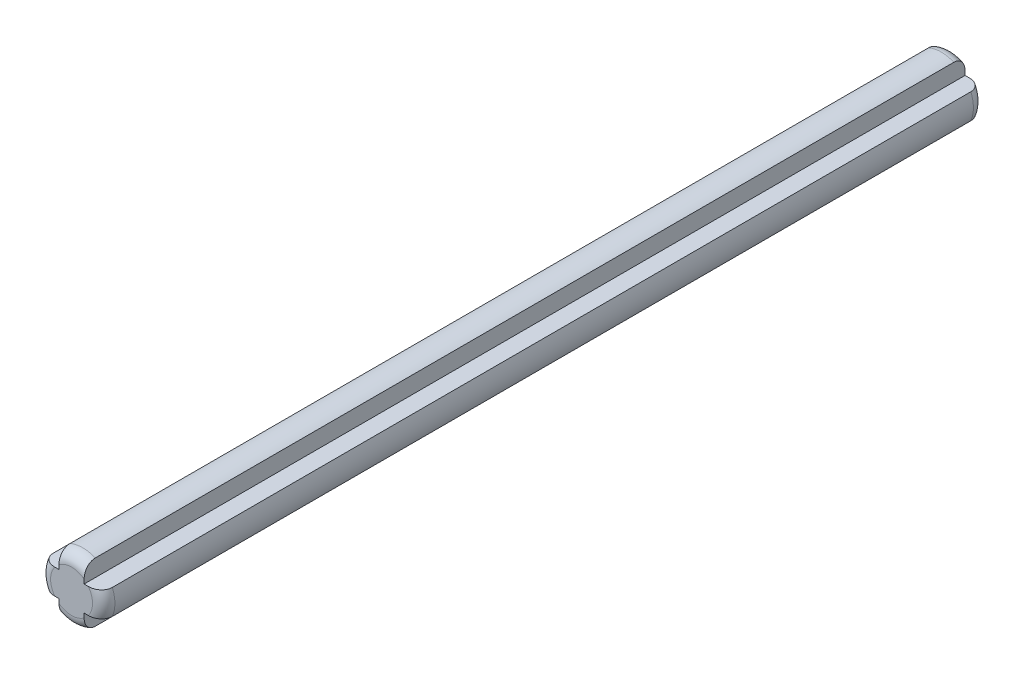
ISO-10303-21;
HEADER;
FILE_DESCRIPTION(('STEP AP214'),'2;1');
FILE_NAME('part.step','',(''),(''),'','','');
FILE_SCHEMA(('AUTOMOTIVE_DESIGN { 1 0 10303 214 1 1 1 1 }'));
ENDSEC;
DATA;
#1=APPLICATION_CONTEXT('core data for automotive mechanical design processes');
#2=APPLICATION_PROTOCOL_DEFINITION('international standard','automotive_design',2000,#1);
#3=PRODUCT_CONTEXT('',#1,'mechanical');
#4=PRODUCT('Part','Part','',(#3));
#5=PRODUCT_RELATED_PRODUCT_CATEGORY('part','',(#4));
#6=PRODUCT_DEFINITION_FORMATION('','',#4);
#7=PRODUCT_DEFINITION_CONTEXT('part definition',#1,'design');
#8=PRODUCT_DEFINITION('design','',#6,#7);
#9=PRODUCT_DEFINITION_SHAPE('','',#8);
#10=(LENGTH_UNIT() NAMED_UNIT(*) SI_UNIT(.MILLI.,.METRE.));
#11=(NAMED_UNIT(*) PLANE_ANGLE_UNIT() SI_UNIT($,.RADIAN.));
#12=(NAMED_UNIT(*) SI_UNIT($,.STERADIAN.) SOLID_ANGLE_UNIT());
#13=UNCERTAINTY_MEASURE_WITH_UNIT(LENGTH_MEASURE(1.E-05),#10,'distance_accuracy_value','');
#14=(GEOMETRIC_REPRESENTATION_CONTEXT(3) GLOBAL_UNCERTAINTY_ASSIGNED_CONTEXT((#13)) GLOBAL_UNIT_ASSIGNED_CONTEXT((#10,
#11,#12)) REPRESENTATION_CONTEXT('',''));
#15=CARTESIAN_POINT('',(0.,0.,0.));
#16=DIRECTION('',(0.,0.,1.));
#17=DIRECTION('',(1.,0.,0.));
#18=AXIS2_PLACEMENT_3D('',#15,#16,#17);
#19=CARTESIAN_POINT('',(0.9,0.,-63.));
#20=DIRECTION('',(-1.,0.,0.));
#21=DIRECTION('',(0.,0.,1.));
#22=AXIS2_PLACEMENT_3D('',#19,#20,#21);
#23=PLANE('',#22);
#24=DIRECTION('',(0.,-1.,0.));
#25=VECTOR('',#24,1.);
#26=CARTESIAN_POINT('',(0.9,0.,-63.));
#27=LINE('',#26,#25);
#28=CARTESIAN_POINT('',(0.9,1.2,-63.));
#29=VERTEX_POINT('',#28);
#30=CARTESIAN_POINT('',(0.9,0.9,-63.));
#31=VERTEX_POINT('',#30);
#32=EDGE_CURVE('E202',#29,#31,#27,.T.);
#33=ORIENTED_EDGE('',*,*,#32,.F.);
#34=CARTESIAN_POINT('',(0.9,1.2,-63.));
#35=CARTESIAN_POINT('',(0.9,1.23177264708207,-62.9999988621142));
#36=CARTESIAN_POINT('',(0.9,1.26353737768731,-62.9987861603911));
#37=CARTESIAN_POINT('',(0.9,1.32690893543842,-62.9937439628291));
#38=CARTESIAN_POINT('',(0.9,1.35851541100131,-62.9899101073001));
#39=CARTESIAN_POINT('',(0.9,1.45291091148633,-62.9741597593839));
#40=CARTESIAN_POINT('',(0.9,1.51508424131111,-62.9579921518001));
#41=CARTESIAN_POINT('',(0.9,1.62122301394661,-62.9186762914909));
#42=CARTESIAN_POINT('',(0.9,1.66610240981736,-62.8979677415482));
#43=CARTESIAN_POINT('',(0.9,1.75174308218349,-62.8494286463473));
#44=CARTESIAN_POINT('',(0.9,1.79251387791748,-62.8216151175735));
#45=CARTESIAN_POINT('',(0.9,1.86875694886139,-62.7590609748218));
#46=CARTESIAN_POINT('',(0.9,1.90419849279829,-62.7242826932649));
#47=CARTESIAN_POINT('',(0.9,1.96804173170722,-62.6487024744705));
#48=CARTESIAN_POINT('',(0.9,1.99643996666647,-62.607897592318));
#49=CARTESIAN_POINT('',(0.9,2.04263429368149,-62.5255349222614));
#50=CARTESIAN_POINT('',(0.9,2.06116131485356,-62.4843855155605));
#51=CARTESIAN_POINT('',(0.9,2.09051404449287,-62.3994647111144));
#52=CARTESIAN_POINT('',(0.9,2.10135386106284,-62.3556982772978));
#53=CARTESIAN_POINT('',(0.9,2.11095369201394,-62.2929302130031));
#54=CARTESIAN_POINT('',(0.9,2.11307132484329,-62.2743928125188));
#55=CARTESIAN_POINT('',(0.9,2.11589349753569,-62.2372401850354));
#56=CARTESIAN_POINT('',(0.9,2.1166002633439,-62.2186251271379));
#57=CARTESIAN_POINT('',(0.9,2.11660104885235,-62.2000000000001));
#58=B_SPLINE_CURVE_WITH_KNOTS('',3,(#34,#35,#36,#37,#38,#39,#40,#41,#42,#43,#44,#45,#46,#47,#48,
#49,#50,#51,#52,#53,#54,#55,#56,#57),.UNSPECIFIED.,.F.,.F.,(4,2,2,2,2,2,2,2,2,2,2,4),(0.,
0.0952699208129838,0.190698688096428,0.38212422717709,0.529802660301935,0.677130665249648,
0.825278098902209,0.973498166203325,1.10819470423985,1.24264339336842,1.29857368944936,
1.35441567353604),.UNSPECIFIED.);
#59=CARTESIAN_POINT('',(0.9,2.11660104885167,-62.2));
#60=VERTEX_POINT('',#59);
#61=EDGE_CURVE('E366',#29,#60,#58,.T.);
#62=ORIENTED_EDGE('',*,*,#61,.T.);
#63=DIRECTION('',(0.,0.,1.));
#64=VECTOR('',#63,1.);
#65=CARTESIAN_POINT('',(0.9,2.11660104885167,-63.));
#66=LINE('',#65,#64);
#67=CARTESIAN_POINT('',(0.9,2.11660104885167,-0.800000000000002));
#68=VERTEX_POINT('',#67);
#69=EDGE_CURVE('E232',#60,#68,#66,.T.);
#70=ORIENTED_EDGE('',*,*,#69,.T.);
#71=CARTESIAN_POINT('',(0.9,2.11660104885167,-0.800000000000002));
#72=CARTESIAN_POINT('',(0.9,2.11664820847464,-0.757867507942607));
#73=CARTESIAN_POINT('',(0.9,2.11298761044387,-0.715759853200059));
#74=CARTESIAN_POINT('',(0.9,2.09861504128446,-0.63286952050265));
#75=CARTESIAN_POINT('',(0.9,2.08792060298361,-0.592083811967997));
#76=CARTESIAN_POINT('',(0.9,2.05984193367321,-0.512893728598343));
#77=CARTESIAN_POINT('',(0.9,2.0424580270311,-0.474489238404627));
#78=CARTESIAN_POINT('',(0.9,2.00163237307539,-0.401044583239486));
#79=CARTESIAN_POINT('',(0.9,1.9781885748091,-0.36600556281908));
#80=CARTESIAN_POINT('',(0.9,1.92541056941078,-0.299327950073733));
#81=CARTESIAN_POINT('',(0.9,1.89594969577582,-0.267789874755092));
#82=CARTESIAN_POINT('',(0.9,1.83247761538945,-0.209727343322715));
#83=CARTESIAN_POINT('',(0.9,1.79846712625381,-0.183202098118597));
#84=CARTESIAN_POINT('',(0.9,1.72434385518,-0.13382906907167));
#85=CARTESIAN_POINT('',(0.9,1.68396944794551,-0.111374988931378));
#86=CARTESIAN_POINT('',(0.9,1.60027120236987,-0.0727387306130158));
#87=CARTESIAN_POINT('',(0.9,1.55694210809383,-0.0565680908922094));
#88=CARTESIAN_POINT('',(0.9,1.46195018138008,-0.0284954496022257));
#89=CARTESIAN_POINT('',(0.9,1.40999804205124,-0.0175692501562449));
#90=CARTESIAN_POINT('',(0.9,1.33146710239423,-0.00688571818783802));
#91=CARTESIAN_POINT('',(0.9,1.30523100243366,-0.0042751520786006));
#92=CARTESIAN_POINT('',(0.9,1.25266468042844,-0.000833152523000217));
#93=CARTESIAN_POINT('',(0.9,1.22633456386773,-1.25965905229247E-07));
#94=CARTESIAN_POINT('',(0.9,1.2,0.));
#95=B_SPLINE_CURVE_WITH_KNOTS('',3,(#71,#72,#73,#74,#75,#76,#77,#78,#79,#80,#81,#82,#83,#84,#85,
#86,#87,#88,#89,#90,#91,#92,#93,#94),.UNSPECIFIED.,.F.,.F.,(4,2,2,2,2,2,2,2,2,2,2,4),(0.,
0.12620055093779,0.252087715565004,0.377968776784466,0.503892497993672,0.632806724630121,
0.761700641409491,0.899726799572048,1.03800523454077,1.19659344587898,1.27564166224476,
1.35461900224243),.UNSPECIFIED.);
#96=CARTESIAN_POINT('',(0.9,1.2,0.));
#97=VERTEX_POINT('',#96);
#98=EDGE_CURVE('E373',#68,#97,#95,.T.);
#99=ORIENTED_EDGE('',*,*,#98,.T.);
#100=DIRECTION('',(0.,-1.,0.));
#101=VECTOR('',#100,1.);
#102=CARTESIAN_POINT('',(0.9,0.,0.));
#103=LINE('',#102,#101);
#104=CARTESIAN_POINT('',(0.9,0.9,0.));
#105=VERTEX_POINT('',#104);
#106=EDGE_CURVE('E233',#97,#105,#103,.T.);
#107=ORIENTED_EDGE('',*,*,#106,.T.);
#108=DIRECTION('',(0.,0.,1.));
#109=VECTOR('',#108,1.);
#110=CARTESIAN_POINT('',(0.9,0.9,-63.));
#111=LINE('',#110,#109);
#112=EDGE_CURVE('E251',#31,#105,#111,.T.);
#113=ORIENTED_EDGE('',*,*,#112,.F.);
#114=EDGE_LOOP('',(#33,#62,#70,#99,#107,#113));
#115=FACE_BOUND('',#114,.T.);
#116=ADVANCED_FACE('F45',(#115),#23,.F.);
#117=CARTESIAN_POINT('',(0.,0.9,-63.));
#118=DIRECTION('',(0.,-1.,0.));
#119=DIRECTION('',(0.,0.,-1.));
#120=AXIS2_PLACEMENT_3D('',#117,#118,#119);
#121=PLANE('',#120);
#122=DIRECTION('',(0.,0.,1.));
#123=VECTOR('',#122,1.);
#124=CARTESIAN_POINT('',(2.11660104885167,0.9,-63.));
#125=LINE('',#124,#123);
#126=CARTESIAN_POINT('',(2.11660104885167,0.9,-62.2));
#127=VERTEX_POINT('',#126);
#128=CARTESIAN_POINT('',(2.11660104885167,0.9,-0.800000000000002));
#129=VERTEX_POINT('',#128);
#130=EDGE_CURVE('E255',#127,#129,#125,.T.);
#131=ORIENTED_EDGE('',*,*,#130,.F.);
#132=CARTESIAN_POINT('',(2.11660104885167,0.9,-62.2));
#133=CARTESIAN_POINT('',(2.11664820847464,0.9,-62.2421324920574));
#134=CARTESIAN_POINT('',(2.11298761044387,0.9,-62.2842401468));
#135=CARTESIAN_POINT('',(2.09861504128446,0.9,-62.3671304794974));
#136=CARTESIAN_POINT('',(2.0879206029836,0.9,-62.407916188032));
#137=CARTESIAN_POINT('',(2.05984193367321,0.9,-62.4871062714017));
#138=CARTESIAN_POINT('',(2.0424580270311,0.9,-62.5255107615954));
#139=CARTESIAN_POINT('',(2.00163237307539,0.9,-62.5989554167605));
#140=CARTESIAN_POINT('',(1.9781885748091,0.9,-62.6339944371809));
#141=CARTESIAN_POINT('',(1.92541056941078,0.9,-62.7006720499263));
#142=CARTESIAN_POINT('',(1.89594969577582,0.9,-62.7322101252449));
#143=CARTESIAN_POINT('',(1.83247761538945,0.9,-62.7902726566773));
#144=CARTESIAN_POINT('',(1.7984671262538,0.9,-62.8167979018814));
#145=CARTESIAN_POINT('',(1.72434385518,0.9,-62.8661709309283));
#146=CARTESIAN_POINT('',(1.68396944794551,0.9,-62.8886250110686));
#147=CARTESIAN_POINT('',(1.60027120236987,0.9,-62.927261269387));
#148=CARTESIAN_POINT('',(1.55694210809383,0.9,-62.9434319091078));
#149=CARTESIAN_POINT('',(1.46195018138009,0.9,-62.9715045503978));
#150=CARTESIAN_POINT('',(1.40999804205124,0.9,-62.9824307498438));
#151=CARTESIAN_POINT('',(1.33146710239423,0.9,-62.9931142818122));
#152=CARTESIAN_POINT('',(1.30523100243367,0.9,-62.9957248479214));
#153=CARTESIAN_POINT('',(1.25266468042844,0.9,-62.999166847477));
#154=CARTESIAN_POINT('',(1.22633456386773,0.9,-62.9999998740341));
#155=CARTESIAN_POINT('',(1.2,0.9,-63.));
#156=B_SPLINE_CURVE_WITH_KNOTS('',3,(#132,#133,#134,#135,#136,#137,#138,#139,#140,#141,#142,
#143,#144,#145,#146,#147,#148,#149,#150,#151,#152,#153,#154,#155),.UNSPECIFIED.,.F.,.F.,(4,2,2,
2,2,2,2,2,2,2,2,4),(0.,0.126200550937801,0.252087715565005,0.377968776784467,0.503892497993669,
0.632806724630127,0.761700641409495,0.899726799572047,1.03800523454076,1.19659344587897,
1.27564166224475,1.35461900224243),.UNSPECIFIED.);
#157=CARTESIAN_POINT('',(1.2,0.9,-63.));
#158=VERTEX_POINT('',#157);
#159=EDGE_CURVE('E293',#127,#158,#156,.T.);
#160=ORIENTED_EDGE('',*,*,#159,.T.);
#161=DIRECTION('',(1.,0.,0.));
#162=VECTOR('',#161,1.);
#163=CARTESIAN_POINT('',(0.,0.9,-63.));
#164=LINE('',#163,#162);
#165=EDGE_CURVE('E230',#31,#158,#164,.T.);
#166=ORIENTED_EDGE('',*,*,#165,.F.);
#167=ORIENTED_EDGE('',*,*,#112,.T.);
#168=DIRECTION('',(1.,0.,0.));
#169=VECTOR('',#168,1.);
#170=CARTESIAN_POINT('',(0.,0.9,0.));
#171=LINE('',#170,#169);
#172=CARTESIAN_POINT('',(1.2,0.9,0.));
#173=VERTEX_POINT('',#172);
#174=EDGE_CURVE('E248',#105,#173,#171,.T.);
#175=ORIENTED_EDGE('',*,*,#174,.T.);
#176=CARTESIAN_POINT('',(1.2,0.9,0.));
#177=CARTESIAN_POINT('',(1.23177264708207,0.9,-1.13788575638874E-06));
#178=CARTESIAN_POINT('',(1.26353737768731,0.9,-0.00121383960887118));
#179=CARTESIAN_POINT('',(1.32690893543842,0.9,-0.00625603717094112));
#180=CARTESIAN_POINT('',(1.35851541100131,0.9,-0.0100898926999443));
#181=CARTESIAN_POINT('',(1.45291091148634,0.9,-0.0258402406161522));
#182=CARTESIAN_POINT('',(1.51508424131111,0.9,-0.0420078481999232));
#183=CARTESIAN_POINT('',(1.62122301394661,0.9,-0.0813237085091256));
#184=CARTESIAN_POINT('',(1.66610240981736,0.9,-0.102032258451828));
#185=CARTESIAN_POINT('',(1.7517430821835,0.9,-0.150571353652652));
#186=CARTESIAN_POINT('',(1.79251387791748,0.9,-0.178384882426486));
#187=CARTESIAN_POINT('',(1.8687569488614,0.9,-0.240939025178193));
#188=CARTESIAN_POINT('',(1.9041984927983,0.9,-0.275717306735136));
#189=CARTESIAN_POINT('',(1.96804173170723,0.9,-0.351297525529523));
#190=CARTESIAN_POINT('',(1.99643996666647,0.9,-0.392102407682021));
#191=CARTESIAN_POINT('',(2.04263429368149,0.9,-0.474465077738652));
#192=CARTESIAN_POINT('',(2.06116131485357,0.9,-0.515614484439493));
#193=CARTESIAN_POINT('',(2.09051404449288,0.9,-0.600535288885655));
#194=CARTESIAN_POINT('',(2.10135386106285,0.9,-0.644301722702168));
#195=CARTESIAN_POINT('',(2.11095369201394,0.9,-0.707069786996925));
#196=CARTESIAN_POINT('',(2.11307132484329,0.9,-0.725607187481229));
#197=CARTESIAN_POINT('',(2.11589349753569,0.9,-0.762759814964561));
#198=CARTESIAN_POINT('',(2.1166002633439,0.9,-0.781374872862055));
#199=CARTESIAN_POINT('',(2.11660104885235,0.9,-0.799999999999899));
#200=B_SPLINE_CURVE_WITH_KNOTS('',3,(#176,#177,#178,#179,#180,#181,#182,#183,#184,#185,#186,
#187,#188,#189,#190,#191,#192,#193,#194,#195,#196,#197,#198,#199),.UNSPECIFIED.,.F.,.F.,(4,2,2,
2,2,2,2,2,2,2,2,4),(0.,0.0952699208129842,0.190698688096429,0.382124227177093,0.52980266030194,
0.677130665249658,0.82527809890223,0.973498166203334,1.10819470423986,1.24264339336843,
1.29857368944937,1.35441567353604),.UNSPECIFIED.);
#201=EDGE_CURVE('E285',#173,#129,#200,.T.);
#202=ORIENTED_EDGE('',*,*,#201,.T.);
#203=EDGE_LOOP('',(#131,#160,#166,#167,#175,#202));
#204=FACE_BOUND('',#203,.T.);
#205=ADVANCED_FACE('F303',(#204),#121,.F.);
#206=CARTESIAN_POINT('',(0.,0.,-63.));
#207=DIRECTION('',(0.,0.,1.));
#208=DIRECTION('',(1.,0.,0.));
#209=AXIS2_PLACEMENT_3D('',#206,#207,#208);
#210=CYLINDRICAL_SURFACE('',#209,2.3);
#211=DIRECTION('',(0.,0.,1.));
#212=VECTOR('',#211,1.);
#213=CARTESIAN_POINT('',(2.11660104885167,-0.9,-63.));
#214=LINE('',#213,#212);
#215=CARTESIAN_POINT('',(2.11660104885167,-0.9,-62.2));
#216=VERTEX_POINT('',#215);
#217=CARTESIAN_POINT('',(2.11660104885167,-0.9,-0.800000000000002));
#218=VERTEX_POINT('',#217);
#219=EDGE_CURVE('E258',#216,#218,#214,.T.);
#220=ORIENTED_EDGE('',*,*,#219,.F.);
#221=CARTESIAN_POINT('',(0.,0.,-62.2));
#222=DIRECTION('',(0.,0.,1.));
#223=DIRECTION('',(1.,0.,0.));
#224=AXIS2_PLACEMENT_3D('',#221,#222,#223);
#225=CIRCLE('',#224,2.3);
#226=EDGE_CURVE('E282',#216,#127,#225,.T.);
#227=ORIENTED_EDGE('',*,*,#226,.T.);
#228=ORIENTED_EDGE('',*,*,#130,.T.);
#229=CARTESIAN_POINT('',(0.,0.,-0.800000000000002));
#230=DIRECTION('',(0.,0.,1.));
#231=DIRECTION('',(1.,0.,0.));
#232=AXIS2_PLACEMENT_3D('',#229,#230,#231);
#233=CIRCLE('',#232,2.3);
#234=EDGE_CURVE('E254',#129,#218,#233,.F.);
#235=ORIENTED_EDGE('',*,*,#234,.T.);
#236=EDGE_LOOP('',(#220,#227,#228,#235));
#237=FACE_BOUND('',#236,.T.);
#238=ADVANCED_FACE('F308',(#237),#210,.T.);
#239=CARTESIAN_POINT('',(0.,-0.9,-63.));
#240=DIRECTION('',(0.,-1.,0.));
#241=DIRECTION('',(0.,0.,-1.));
#242=AXIS2_PLACEMENT_3D('',#239,#240,#241);
#243=PLANE('',#242);
#244=DIRECTION('',(1.,0.,0.));
#245=VECTOR('',#244,1.);
#246=CARTESIAN_POINT('',(0.,-0.9,-63.));
#247=LINE('',#246,#245);
#248=CARTESIAN_POINT('',(0.9,-0.9,-63.));
#249=VERTEX_POINT('',#248);
#250=CARTESIAN_POINT('',(1.2,-0.9,-63.));
#251=VERTEX_POINT('',#250);
#252=EDGE_CURVE('E227',#249,#251,#247,.T.);
#253=ORIENTED_EDGE('',*,*,#252,.T.);
#254=CARTESIAN_POINT('',(1.2,-0.9,-63.));
#255=CARTESIAN_POINT('',(1.23177264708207,-0.9,-62.9999988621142));
#256=CARTESIAN_POINT('',(1.26353737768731,-0.9,-62.9987861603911));
#257=CARTESIAN_POINT('',(1.32690893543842,-0.9,-62.9937439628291));
#258=CARTESIAN_POINT('',(1.35851541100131,-0.9,-62.9899101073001));
#259=CARTESIAN_POINT('',(1.45291091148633,-0.9,-62.9741597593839));
#260=CARTESIAN_POINT('',(1.51508424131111,-0.9,-62.9579921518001));
#261=CARTESIAN_POINT('',(1.62122301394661,-0.9,-62.9186762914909));
#262=CARTESIAN_POINT('',(1.66610240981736,-0.9,-62.8979677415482));
#263=CARTESIAN_POINT('',(1.75174308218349,-0.9,-62.8494286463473));
#264=CARTESIAN_POINT('',(1.79251387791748,-0.9,-62.8216151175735));
#265=CARTESIAN_POINT('',(1.86875694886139,-0.9,-62.7590609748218));
#266=CARTESIAN_POINT('',(1.90419849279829,-0.9,-62.7242826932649));
#267=CARTESIAN_POINT('',(1.96804173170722,-0.9,-62.6487024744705));
#268=CARTESIAN_POINT('',(1.99643996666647,-0.9,-62.607897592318));
#269=CARTESIAN_POINT('',(2.04263429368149,-0.9,-62.5255349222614));
#270=CARTESIAN_POINT('',(2.06116131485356,-0.9,-62.4843855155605));
#271=CARTESIAN_POINT('',(2.09051404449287,-0.9,-62.3994647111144));
#272=CARTESIAN_POINT('',(2.10135386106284,-0.9,-62.3556982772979));
#273=CARTESIAN_POINT('',(2.11095369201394,-0.9,-62.2929302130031));
#274=CARTESIAN_POINT('',(2.11307132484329,-0.9,-62.2743928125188));
#275=CARTESIAN_POINT('',(2.11589349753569,-0.9,-62.2372401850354));
#276=CARTESIAN_POINT('',(2.1166002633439,-0.9,-62.2186251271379));
#277=CARTESIAN_POINT('',(2.11660104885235,-0.9,-62.2000000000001));
#278=B_SPLINE_CURVE_WITH_KNOTS('',3,(#254,#255,#256,#257,#258,#259,#260,#261,#262,#263,#264,
#265,#266,#267,#268,#269,#270,#271,#272,#273,#274,#275,#276,#277),.UNSPECIFIED.,.F.,.F.,(4,2,2,
2,2,2,2,2,2,2,2,4),(0.,0.0952699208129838,0.190698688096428,0.38212422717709,0.529802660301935,
0.677130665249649,0.825278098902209,0.973498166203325,1.10819470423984,1.24264339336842,
1.29857368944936,1.35441567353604),.UNSPECIFIED.);
#279=EDGE_CURVE('E334',#251,#216,#278,.T.);
#280=ORIENTED_EDGE('',*,*,#279,.T.);
#281=ORIENTED_EDGE('',*,*,#219,.T.);
#282=CARTESIAN_POINT('',(2.11660104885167,-0.9,-0.800000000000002));
#283=CARTESIAN_POINT('',(2.11664820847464,-0.9,-0.757867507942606));
#284=CARTESIAN_POINT('',(2.11298761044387,-0.9,-0.715759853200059));
#285=CARTESIAN_POINT('',(2.09861504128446,-0.9,-0.63286952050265));
#286=CARTESIAN_POINT('',(2.0879206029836,-0.9,-0.592083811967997));
#287=CARTESIAN_POINT('',(2.05984193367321,-0.9,-0.512893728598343));
#288=CARTESIAN_POINT('',(2.0424580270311,-0.9,-0.474489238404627));
#289=CARTESIAN_POINT('',(2.00163237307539,-0.9,-0.401044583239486));
#290=CARTESIAN_POINT('',(1.9781885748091,-0.9,-0.36600556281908));
#291=CARTESIAN_POINT('',(1.92541056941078,-0.9,-0.299327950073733));
#292=CARTESIAN_POINT('',(1.89594969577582,-0.9,-0.267789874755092));
#293=CARTESIAN_POINT('',(1.83247761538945,-0.9,-0.209727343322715));
#294=CARTESIAN_POINT('',(1.79846712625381,-0.9,-0.183202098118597));
#295=CARTESIAN_POINT('',(1.72434385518,-0.9,-0.13382906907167));
#296=CARTESIAN_POINT('',(1.68396944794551,-0.9,-0.111374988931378));
#297=CARTESIAN_POINT('',(1.60027120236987,-0.9,-0.0727387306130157));
#298=CARTESIAN_POINT('',(1.55694210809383,-0.9,-0.0565680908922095));
#299=CARTESIAN_POINT('',(1.46195018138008,-0.9,-0.0284954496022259));
#300=CARTESIAN_POINT('',(1.40999804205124,-0.9,-0.0175692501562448));
#301=CARTESIAN_POINT('',(1.33146710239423,-0.9,-0.00688571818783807));
#302=CARTESIAN_POINT('',(1.30523100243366,-0.9,-0.00427515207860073));
#303=CARTESIAN_POINT('',(1.25266468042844,-0.9,-0.000833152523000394));
#304=CARTESIAN_POINT('',(1.22633456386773,-0.9,-1.25965905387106E-07));
#305=CARTESIAN_POINT('',(1.2,-0.9,0.));
#306=B_SPLINE_CURVE_WITH_KNOTS('',3,(#282,#283,#284,#285,#286,#287,#288,#289,#290,#291,#292,
#293,#294,#295,#296,#297,#298,#299,#300,#301,#302,#303,#304,#305),.UNSPECIFIED.,.F.,.F.,(4,2,2,
2,2,2,2,2,2,2,2,4),(0.,0.126200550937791,0.252087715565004,0.377968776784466,0.503892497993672,
0.632806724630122,0.761700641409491,0.899726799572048,1.03800523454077,1.19659344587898,
1.27564166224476,1.35461900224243),.UNSPECIFIED.);
#307=CARTESIAN_POINT('',(1.2,-0.9,0.));
#308=VERTEX_POINT('',#307);
#309=EDGE_CURVE('E327',#218,#308,#306,.T.);
#310=ORIENTED_EDGE('',*,*,#309,.T.);
#311=DIRECTION('',(1.,0.,0.));
#312=VECTOR('',#311,1.);
#313=CARTESIAN_POINT('',(0.,-0.9,0.));
#314=LINE('',#313,#312);
#315=CARTESIAN_POINT('',(0.9,-0.9,0.));
#316=VERTEX_POINT('',#315);
#317=EDGE_CURVE('E245',#316,#308,#314,.T.);
#318=ORIENTED_EDGE('',*,*,#317,.F.);
#319=DIRECTION('',(0.,0.,1.));
#320=VECTOR('',#319,1.);
#321=CARTESIAN_POINT('',(0.9,-0.9,-63.));
#322=LINE('',#321,#320);
#323=EDGE_CURVE('E261',#249,#316,#322,.T.);
#324=ORIENTED_EDGE('',*,*,#323,.F.);
#325=EDGE_LOOP('',(#253,#280,#281,#310,#318,#324));
#326=FACE_BOUND('',#325,.T.);
#327=ADVANCED_FACE('F315',(#326),#243,.T.);
#328=CARTESIAN_POINT('',(0.9,0.,-63.));
#329=DIRECTION('',(1.,0.,0.));
#330=DIRECTION('',(0.,0.,-1.));
#331=AXIS2_PLACEMENT_3D('',#328,#329,#330);
#332=PLANE('',#331);
#333=DIRECTION('',(0.,0.,1.));
#334=VECTOR('',#333,1.);
#335=CARTESIAN_POINT('',(0.9,-2.11660104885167,-63.));
#336=LINE('',#335,#334);
#337=CARTESIAN_POINT('',(0.9,-2.11660104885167,-62.2));
#338=VERTEX_POINT('',#337);
#339=CARTESIAN_POINT('',(0.9,-2.11660104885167,-0.800000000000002));
#340=VERTEX_POINT('',#339);
#341=EDGE_CURVE('E264',#338,#340,#336,.T.);
#342=ORIENTED_EDGE('',*,*,#341,.F.);
#343=CARTESIAN_POINT('',(0.9,-2.11660104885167,-62.2));
#344=CARTESIAN_POINT('',(0.9,-2.11664820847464,-62.2421324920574));
#345=CARTESIAN_POINT('',(0.9,-2.11298761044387,-62.2842401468));
#346=CARTESIAN_POINT('',(0.9,-2.09861504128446,-62.3671304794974));
#347=CARTESIAN_POINT('',(0.9,-2.0879206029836,-62.407916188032));
#348=CARTESIAN_POINT('',(0.9,-2.05984193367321,-62.4871062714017));
#349=CARTESIAN_POINT('',(0.9,-2.0424580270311,-62.5255107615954));
#350=CARTESIAN_POINT('',(0.9,-2.00163237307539,-62.5989554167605));
#351=CARTESIAN_POINT('',(0.9,-1.9781885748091,-62.6339944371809));
#352=CARTESIAN_POINT('',(0.9,-1.92541056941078,-62.7006720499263));
#353=CARTESIAN_POINT('',(0.9,-1.89594969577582,-62.7322101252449));
#354=CARTESIAN_POINT('',(0.9,-1.83247761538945,-62.7902726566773));
#355=CARTESIAN_POINT('',(0.9,-1.7984671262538,-62.8167979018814));
#356=CARTESIAN_POINT('',(0.9,-1.72434385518,-62.8661709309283));
#357=CARTESIAN_POINT('',(0.9,-1.68396944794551,-62.8886250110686));
#358=CARTESIAN_POINT('',(0.9,-1.60027120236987,-62.927261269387));
#359=CARTESIAN_POINT('',(0.9,-1.55694210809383,-62.9434319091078));
#360=CARTESIAN_POINT('',(0.9,-1.46195018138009,-62.9715045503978));
#361=CARTESIAN_POINT('',(0.9,-1.40999804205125,-62.9824307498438));
#362=CARTESIAN_POINT('',(0.9,-1.33146710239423,-62.9931142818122));
#363=CARTESIAN_POINT('',(0.9,-1.30523100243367,-62.9957248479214));
#364=CARTESIAN_POINT('',(0.9,-1.25266468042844,-62.999166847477));
#365=CARTESIAN_POINT('',(0.9,-1.22633456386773,-62.9999998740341));
#366=CARTESIAN_POINT('',(0.9,-1.2,-63.));
#367=B_SPLINE_CURVE_WITH_KNOTS('',3,(#343,#344,#345,#346,#347,#348,#349,#350,#351,#352,#353,
#354,#355,#356,#357,#358,#359,#360,#361,#362,#363,#364,#365,#366),.UNSPECIFIED.,.F.,.F.,(4,2,2,
2,2,2,2,2,2,2,2,4),(0.,0.126200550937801,0.252087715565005,0.377968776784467,0.503892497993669,
0.632806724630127,0.761700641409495,0.899726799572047,1.03800523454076,1.19659344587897,
1.27564166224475,1.35461900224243),.UNSPECIFIED.);
#368=CARTESIAN_POINT('',(0.9,-1.2,-63.));
#369=VERTEX_POINT('',#368);
#370=EDGE_CURVE('E75',#338,#369,#367,.T.);
#371=ORIENTED_EDGE('',*,*,#370,.T.);
#372=DIRECTION('',(0.,1.,0.));
#373=VECTOR('',#372,1.);
#374=CARTESIAN_POINT('',(0.9,0.,-63.));
#375=LINE('',#374,#373);
#376=EDGE_CURVE('E225',#369,#249,#375,.T.);
#377=ORIENTED_EDGE('',*,*,#376,.T.);
#378=ORIENTED_EDGE('',*,*,#323,.T.);
#379=DIRECTION('',(0.,1.,0.));
#380=VECTOR('',#379,1.);
#381=CARTESIAN_POINT('',(0.9,0.,0.));
#382=LINE('',#381,#380);
#383=CARTESIAN_POINT('',(0.9,-1.2,0.));
#384=VERTEX_POINT('',#383);
#385=EDGE_CURVE('E243',#384,#316,#382,.T.);
#386=ORIENTED_EDGE('',*,*,#385,.F.);
#387=CARTESIAN_POINT('',(0.9,-1.2,0.));
#388=CARTESIAN_POINT('',(0.9,-1.23177264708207,-1.13788575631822E-06));
#389=CARTESIAN_POINT('',(0.9,-1.26353737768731,-0.00121383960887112));
#390=CARTESIAN_POINT('',(0.9,-1.32690893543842,-0.00625603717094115));
#391=CARTESIAN_POINT('',(0.9,-1.35851541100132,-0.0100898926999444));
#392=CARTESIAN_POINT('',(0.9,-1.45291091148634,-0.0258402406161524));
#393=CARTESIAN_POINT('',(0.9,-1.51508424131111,-0.0420078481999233));
#394=CARTESIAN_POINT('',(0.9,-1.62122301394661,-0.0813237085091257));
#395=CARTESIAN_POINT('',(0.9,-1.66610240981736,-0.102032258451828));
#396=CARTESIAN_POINT('',(0.9,-1.7517430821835,-0.150571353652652));
#397=CARTESIAN_POINT('',(0.9,-1.79251387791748,-0.178384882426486));
#398=CARTESIAN_POINT('',(0.9,-1.8687569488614,-0.240939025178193));
#399=CARTESIAN_POINT('',(0.9,-1.9041984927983,-0.275717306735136));
#400=CARTESIAN_POINT('',(0.9,-1.96804173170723,-0.351297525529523));
#401=CARTESIAN_POINT('',(0.9,-1.99643996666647,-0.39210240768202));
#402=CARTESIAN_POINT('',(0.9,-2.04263429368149,-0.474465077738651));
#403=CARTESIAN_POINT('',(0.9,-2.06116131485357,-0.515614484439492));
#404=CARTESIAN_POINT('',(0.9,-2.09051404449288,-0.600535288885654));
#405=CARTESIAN_POINT('',(0.9,-2.10135386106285,-0.644301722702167));
#406=CARTESIAN_POINT('',(0.9,-2.11095369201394,-0.707069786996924));
#407=CARTESIAN_POINT('',(0.9,-2.11307132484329,-0.725607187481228));
#408=CARTESIAN_POINT('',(0.9,-2.11589349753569,-0.762759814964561));
#409=CARTESIAN_POINT('',(0.9,-2.1166002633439,-0.781374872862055));
#410=CARTESIAN_POINT('',(0.9,-2.11660104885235,-0.799999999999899));
#411=B_SPLINE_CURVE_WITH_KNOTS('',3,(#387,#388,#389,#390,#391,#392,#393,#394,#395,#396,#397,
#398,#399,#400,#401,#402,#403,#404,#405,#406,#407,#408,#409,#410),.UNSPECIFIED.,.F.,.F.,(4,2,2,
2,2,2,2,2,2,2,2,4),(0.,0.0952699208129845,0.190698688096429,0.382124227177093,0.52980266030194,
0.677130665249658,0.82527809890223,0.973498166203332,1.10819470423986,1.24264339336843,
1.29857368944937,1.35441567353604),.UNSPECIFIED.);
#412=EDGE_CURVE('E67',#384,#340,#411,.T.);
#413=ORIENTED_EDGE('',*,*,#412,.T.);
#414=EDGE_LOOP('',(#342,#371,#377,#378,#386,#413));
#415=FACE_BOUND('',#414,.T.);
#416=ADVANCED_FACE('F322',(#415),#332,.T.);
#417=DIRECTION('',(0.,0.,1.));
#418=VECTOR('',#417,1.);
#419=CARTESIAN_POINT('',(-0.9,-2.11660104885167,-63.));
#420=LINE('',#419,#418);
#421=CARTESIAN_POINT('',(-0.9,-2.11660104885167,-62.2));
#422=VERTEX_POINT('',#421);
#423=CARTESIAN_POINT('',(-0.9,-2.11660104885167,-0.800000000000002));
#424=VERTEX_POINT('',#423);
#425=EDGE_CURVE('E266',#422,#424,#420,.T.);
#426=ORIENTED_EDGE('',*,*,#425,.F.);
#427=CARTESIAN_POINT('',(0.,0.,-62.2));
#428=DIRECTION('',(0.,0.,1.));
#429=DIRECTION('',(1.,0.,0.));
#430=AXIS2_PLACEMENT_3D('',#427,#428,#429);
#431=CIRCLE('',#430,2.3);
#432=EDGE_CURVE('E437',#422,#338,#431,.T.);
#433=ORIENTED_EDGE('',*,*,#432,.T.);
#434=ORIENTED_EDGE('',*,*,#341,.T.);
#435=CARTESIAN_POINT('',(0.,0.,-0.800000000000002));
#436=DIRECTION('',(0.,0.,1.));
#437=DIRECTION('',(1.,0.,0.));
#438=AXIS2_PLACEMENT_3D('',#435,#436,#437);
#439=CIRCLE('',#438,2.3);
#440=EDGE_CURVE('E435',#340,#424,#439,.F.);
#441=ORIENTED_EDGE('',*,*,#440,.T.);
#442=EDGE_LOOP('',(#426,#433,#434,#441));
#443=FACE_BOUND('',#442,.T.);
#444=ADVANCED_FACE('F318',(#443),#210,.T.);
#445=CARTESIAN_POINT('',(-0.9,0.,-63.));
#446=DIRECTION('',(1.,0.,0.));
#447=DIRECTION('',(0.,0.,-1.));
#448=AXIS2_PLACEMENT_3D('',#445,#446,#447);
#449=PLANE('',#448);
#450=DIRECTION('',(0.,1.,0.));
#451=VECTOR('',#450,1.);
#452=CARTESIAN_POINT('',(-0.9,0.,-63.));
#453=LINE('',#452,#451);
#454=CARTESIAN_POINT('',(-0.9,-1.2,-63.));
#455=VERTEX_POINT('',#454);
#456=CARTESIAN_POINT('',(-0.9,-0.9,-63.));
#457=VERTEX_POINT('',#456);
#458=EDGE_CURVE('E220',#455,#457,#453,.T.);
#459=ORIENTED_EDGE('',*,*,#458,.F.);
#460=CARTESIAN_POINT('',(-0.9,-1.2,-63.));
#461=CARTESIAN_POINT('',(-0.9,-1.23177264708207,-62.9999988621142));
#462=CARTESIAN_POINT('',(-0.9,-1.26353737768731,-62.9987861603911));
#463=CARTESIAN_POINT('',(-0.9,-1.32690893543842,-62.9937439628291));
#464=CARTESIAN_POINT('',(-0.9,-1.35851541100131,-62.9899101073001));
#465=CARTESIAN_POINT('',(-0.9,-1.45291091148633,-62.9741597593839));
#466=CARTESIAN_POINT('',(-0.9,-1.51508424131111,-62.9579921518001));
#467=CARTESIAN_POINT('',(-0.9,-1.62122301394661,-62.9186762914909));
#468=CARTESIAN_POINT('',(-0.9,-1.66610240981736,-62.8979677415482));
#469=CARTESIAN_POINT('',(-0.9,-1.75174308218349,-62.8494286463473));
#470=CARTESIAN_POINT('',(-0.9,-1.79251387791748,-62.8216151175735));
#471=CARTESIAN_POINT('',(-0.9,-1.86875694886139,-62.7590609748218));
#472=CARTESIAN_POINT('',(-0.9,-1.90419849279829,-62.7242826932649));
#473=CARTESIAN_POINT('',(-0.9,-1.96804173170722,-62.6487024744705));
#474=CARTESIAN_POINT('',(-0.9,-1.99643996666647,-62.607897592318));
#475=CARTESIAN_POINT('',(-0.9,-2.04263429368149,-62.5255349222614));
#476=CARTESIAN_POINT('',(-0.9,-2.06116131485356,-62.4843855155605));
#477=CARTESIAN_POINT('',(-0.9,-2.09051404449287,-62.3994647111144));
#478=CARTESIAN_POINT('',(-0.9,-2.10135386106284,-62.3556982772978));
#479=CARTESIAN_POINT('',(-0.9,-2.11095369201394,-62.2929302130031));
#480=CARTESIAN_POINT('',(-0.9,-2.11307132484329,-62.2743928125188));
#481=CARTESIAN_POINT('',(-0.9,-2.11589349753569,-62.2372401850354));
#482=CARTESIAN_POINT('',(-0.9,-2.1166002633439,-62.2186251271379));
#483=CARTESIAN_POINT('',(-0.9,-2.11660104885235,-62.2000000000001));
#484=B_SPLINE_CURVE_WITH_KNOTS('',3,(#460,#461,#462,#463,#464,#465,#466,#467,#468,#469,#470,
#471,#472,#473,#474,#475,#476,#477,#478,#479,#480,#481,#482,#483),.UNSPECIFIED.,.F.,.F.,(4,2,2,
2,2,2,2,2,2,2,2,4),(0.,0.0952699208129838,0.190698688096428,0.38212422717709,0.529802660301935,
0.677130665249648,0.825278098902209,0.973498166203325,1.10819470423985,1.24264339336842,
1.29857368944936,1.35441567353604),.UNSPECIFIED.);
#485=EDGE_CURVE('E11',#455,#422,#484,.T.);
#486=ORIENTED_EDGE('',*,*,#485,.T.);
#487=ORIENTED_EDGE('',*,*,#425,.T.);
#488=CARTESIAN_POINT('',(-0.9,-2.11660104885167,-0.800000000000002));
#489=CARTESIAN_POINT('',(-0.9,-2.11664820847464,-0.757867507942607));
#490=CARTESIAN_POINT('',(-0.9,-2.11298761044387,-0.715759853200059));
#491=CARTESIAN_POINT('',(-0.9,-2.09861504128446,-0.63286952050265));
#492=CARTESIAN_POINT('',(-0.9,-2.08792060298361,-0.592083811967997));
#493=CARTESIAN_POINT('',(-0.9,-2.05984193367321,-0.512893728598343));
#494=CARTESIAN_POINT('',(-0.9,-2.0424580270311,-0.474489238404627));
#495=CARTESIAN_POINT('',(-0.9,-2.00163237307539,-0.401044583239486));
#496=CARTESIAN_POINT('',(-0.9,-1.9781885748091,-0.36600556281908));
#497=CARTESIAN_POINT('',(-0.9,-1.92541056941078,-0.299327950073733));
#498=CARTESIAN_POINT('',(-0.9,-1.89594969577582,-0.267789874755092));
#499=CARTESIAN_POINT('',(-0.9,-1.83247761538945,-0.209727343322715));
#500=CARTESIAN_POINT('',(-0.9,-1.79846712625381,-0.183202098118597));
#501=CARTESIAN_POINT('',(-0.9,-1.72434385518,-0.13382906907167));
#502=CARTESIAN_POINT('',(-0.9,-1.68396944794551,-0.111374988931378));
#503=CARTESIAN_POINT('',(-0.9,-1.60027120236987,-0.0727387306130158));
#504=CARTESIAN_POINT('',(-0.9,-1.55694210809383,-0.0565680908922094));
#505=CARTESIAN_POINT('',(-0.9,-1.46195018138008,-0.0284954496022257));
#506=CARTESIAN_POINT('',(-0.9,-1.40999804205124,-0.0175692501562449));
#507=CARTESIAN_POINT('',(-0.9,-1.33146710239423,-0.00688571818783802));
#508=CARTESIAN_POINT('',(-0.9,-1.30523100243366,-0.0042751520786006));
#509=CARTESIAN_POINT('',(-0.9,-1.25266468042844,-0.000833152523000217));
#510=CARTESIAN_POINT('',(-0.9,-1.22633456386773,-1.25965905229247E-07));
#511=CARTESIAN_POINT('',(-0.9,-1.2,0.));
#512=B_SPLINE_CURVE_WITH_KNOTS('',3,(#488,#489,#490,#491,#492,#493,#494,#495,#496,#497,#498,
#499,#500,#501,#502,#503,#504,#505,#506,#507,#508,#509,#510,#511),.UNSPECIFIED.,.F.,.F.,(4,2,2,
2,2,2,2,2,2,2,2,4),(0.,0.12620055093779,0.252087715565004,0.377968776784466,0.503892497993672,
0.632806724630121,0.761700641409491,0.899726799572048,1.03800523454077,1.19659344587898,
1.27564166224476,1.35461900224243),.UNSPECIFIED.);
#513=CARTESIAN_POINT('',(-0.9,-1.2,0.));
#514=VERTEX_POINT('',#513);
#515=EDGE_CURVE('E60',#424,#514,#512,.T.);
#516=ORIENTED_EDGE('',*,*,#515,.T.);
#517=DIRECTION('',(0.,1.,0.));
#518=VECTOR('',#517,1.);
#519=CARTESIAN_POINT('',(-0.9,0.,0.));
#520=LINE('',#519,#518);
#521=CARTESIAN_POINT('',(-0.9,-0.9,0.));
#522=VERTEX_POINT('',#521);
#523=EDGE_CURVE('E241',#514,#522,#520,.T.);
#524=ORIENTED_EDGE('',*,*,#523,.T.);
#525=DIRECTION('',(0.,0.,1.));
#526=VECTOR('',#525,1.);
#527=CARTESIAN_POINT('',(-0.9,-0.9,-63.));
#528=LINE('',#527,#526);
#529=EDGE_CURVE('E269',#457,#522,#528,.T.);
#530=ORIENTED_EDGE('',*,*,#529,.F.);
#531=EDGE_LOOP('',(#459,#486,#487,#516,#524,#530));
#532=FACE_BOUND('',#531,.T.);
#533=ADVANCED_FACE('F403',(#532),#449,.F.);
#534=CARTESIAN_POINT('',(0.,-0.9,-63.));
#535=DIRECTION('',(0.,1.,0.));
#536=DIRECTION('',(0.,0.,1.));
#537=AXIS2_PLACEMENT_3D('',#534,#535,#536);
#538=PLANE('',#537);
#539=DIRECTION('',(0.,0.,1.));
#540=VECTOR('',#539,1.);
#541=CARTESIAN_POINT('',(-2.11660104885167,-0.9,-63.));
#542=LINE('',#541,#540);
#543=CARTESIAN_POINT('',(-2.11660104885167,-0.9,-62.2));
#544=VERTEX_POINT('',#543);
#545=CARTESIAN_POINT('',(-2.11660104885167,-0.9,-0.800000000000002));
#546=VERTEX_POINT('',#545);
#547=EDGE_CURVE('E272',#544,#546,#542,.T.);
#548=ORIENTED_EDGE('',*,*,#547,.F.);
#549=CARTESIAN_POINT('',(-2.11660104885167,-0.9,-62.2));
#550=CARTESIAN_POINT('',(-2.11664820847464,-0.9,-62.2421324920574));
#551=CARTESIAN_POINT('',(-2.11298761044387,-0.9,-62.2842401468));
#552=CARTESIAN_POINT('',(-2.09861504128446,-0.9,-62.3671304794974));
#553=CARTESIAN_POINT('',(-2.0879206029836,-0.9,-62.407916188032));
#554=CARTESIAN_POINT('',(-2.05984193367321,-0.9,-62.4871062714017));
#555=CARTESIAN_POINT('',(-2.0424580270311,-0.9,-62.5255107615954));
#556=CARTESIAN_POINT('',(-2.00163237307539,-0.9,-62.5989554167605));
#557=CARTESIAN_POINT('',(-1.9781885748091,-0.9,-62.6339944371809));
#558=CARTESIAN_POINT('',(-1.92541056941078,-0.9,-62.7006720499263));
#559=CARTESIAN_POINT('',(-1.89594969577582,-0.9,-62.7322101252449));
#560=CARTESIAN_POINT('',(-1.83247761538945,-0.9,-62.7902726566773));
#561=CARTESIAN_POINT('',(-1.7984671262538,-0.9,-62.8167979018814));
#562=CARTESIAN_POINT('',(-1.72434385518,-0.9,-62.8661709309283));
#563=CARTESIAN_POINT('',(-1.68396944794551,-0.9,-62.8886250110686));
#564=CARTESIAN_POINT('',(-1.60027120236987,-0.9,-62.927261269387));
#565=CARTESIAN_POINT('',(-1.55694210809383,-0.9,-62.9434319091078));
#566=CARTESIAN_POINT('',(-1.46195018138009,-0.9,-62.9715045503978));
#567=CARTESIAN_POINT('',(-1.40999804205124,-0.9,-62.9824307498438));
#568=CARTESIAN_POINT('',(-1.33146710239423,-0.9,-62.9931142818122));
#569=CARTESIAN_POINT('',(-1.30523100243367,-0.9,-62.9957248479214));
#570=CARTESIAN_POINT('',(-1.25266468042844,-0.9,-62.999166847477));
#571=CARTESIAN_POINT('',(-1.22633456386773,-0.9,-62.9999998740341));
#572=CARTESIAN_POINT('',(-1.2,-0.9,-63.));
#573=B_SPLINE_CURVE_WITH_KNOTS('',3,(#549,#550,#551,#552,#553,#554,#555,#556,#557,#558,#559,
#560,#561,#562,#563,#564,#565,#566,#567,#568,#569,#570,#571,#572),.UNSPECIFIED.,.F.,.F.,(4,2,2,
2,2,2,2,2,2,2,2,4),(0.,0.126200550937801,0.252087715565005,0.377968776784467,0.503892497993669,
0.632806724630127,0.761700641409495,0.899726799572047,1.03800523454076,1.19659344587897,
1.27564166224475,1.35461900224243),.UNSPECIFIED.);
#574=CARTESIAN_POINT('',(-1.2,-0.9,-63.));
#575=VERTEX_POINT('',#574);
#576=EDGE_CURVE('E389',#544,#575,#573,.T.);
#577=ORIENTED_EDGE('',*,*,#576,.T.);
#578=DIRECTION('',(-1.,0.,0.));
#579=VECTOR('',#578,1.);
#580=CARTESIAN_POINT('',(0.,-0.9,-63.));
#581=LINE('',#580,#579);
#582=EDGE_CURVE('E218',#457,#575,#581,.T.);
#583=ORIENTED_EDGE('',*,*,#582,.F.);
#584=ORIENTED_EDGE('',*,*,#529,.T.);
#585=DIRECTION('',(-1.,0.,0.));
#586=VECTOR('',#585,1.);
#587=CARTESIAN_POINT('',(0.,-0.9,0.));
#588=LINE('',#587,#586);
#589=CARTESIAN_POINT('',(-1.2,-0.9,0.));
#590=VERTEX_POINT('',#589);
#591=EDGE_CURVE('E238',#522,#590,#588,.T.);
#592=ORIENTED_EDGE('',*,*,#591,.T.);
#593=CARTESIAN_POINT('',(-1.2,-0.9,0.));
#594=CARTESIAN_POINT('',(-1.23177264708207,-0.9,-1.13788575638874E-06));
#595=CARTESIAN_POINT('',(-1.26353737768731,-0.9,-0.00121383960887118));
#596=CARTESIAN_POINT('',(-1.32690893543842,-0.9,-0.00625603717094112));
#597=CARTESIAN_POINT('',(-1.35851541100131,-0.9,-0.0100898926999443));
#598=CARTESIAN_POINT('',(-1.45291091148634,-0.9,-0.0258402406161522));
#599=CARTESIAN_POINT('',(-1.51508424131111,-0.9,-0.0420078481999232));
#600=CARTESIAN_POINT('',(-1.62122301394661,-0.9,-0.0813237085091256));
#601=CARTESIAN_POINT('',(-1.66610240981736,-0.9,-0.102032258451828));
#602=CARTESIAN_POINT('',(-1.7517430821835,-0.9,-0.150571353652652));
#603=CARTESIAN_POINT('',(-1.79251387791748,-0.9,-0.178384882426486));
#604=CARTESIAN_POINT('',(-1.8687569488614,-0.9,-0.240939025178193));
#605=CARTESIAN_POINT('',(-1.9041984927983,-0.9,-0.275717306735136));
#606=CARTESIAN_POINT('',(-1.96804173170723,-0.9,-0.351297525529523));
#607=CARTESIAN_POINT('',(-1.99643996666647,-0.9,-0.392102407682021));
#608=CARTESIAN_POINT('',(-2.04263429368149,-0.9,-0.474465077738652));
#609=CARTESIAN_POINT('',(-2.06116131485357,-0.9,-0.515614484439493));
#610=CARTESIAN_POINT('',(-2.09051404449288,-0.9,-0.600535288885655));
#611=CARTESIAN_POINT('',(-2.10135386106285,-0.9,-0.644301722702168));
#612=CARTESIAN_POINT('',(-2.11095369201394,-0.9,-0.707069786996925));
#613=CARTESIAN_POINT('',(-2.11307132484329,-0.9,-0.725607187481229));
#614=CARTESIAN_POINT('',(-2.11589349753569,-0.9,-0.762759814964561));
#615=CARTESIAN_POINT('',(-2.1166002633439,-0.9,-0.781374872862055));
#616=CARTESIAN_POINT('',(-2.11660104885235,-0.9,-0.799999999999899));
#617=B_SPLINE_CURVE_WITH_KNOTS('',3,(#593,#594,#595,#596,#597,#598,#599,#600,#601,#602,#603,
#604,#605,#606,#607,#608,#609,#610,#611,#612,#613,#614,#615,#616),.UNSPECIFIED.,.F.,.F.,(4,2,2,
2,2,2,2,2,2,2,2,4),(0.,0.0952699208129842,0.190698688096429,0.382124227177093,0.52980266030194,
0.677130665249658,0.82527809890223,0.973498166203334,1.10819470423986,1.24264339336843,
1.29857368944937,1.35441567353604),.UNSPECIFIED.);
#618=EDGE_CURVE('E382',#590,#546,#617,.T.);
#619=ORIENTED_EDGE('',*,*,#618,.T.);
#620=EDGE_LOOP('',(#548,#577,#583,#584,#592,#619));
#621=FACE_BOUND('',#620,.T.);
#622=ADVANCED_FACE('F398',(#621),#538,.F.);
#623=DIRECTION('',(0.,0.,1.));
#624=VECTOR('',#623,1.);
#625=CARTESIAN_POINT('',(-2.11660104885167,0.9,-63.));
#626=LINE('',#625,#624);
#627=CARTESIAN_POINT('',(-2.11660104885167,0.9,-62.2));
#628=VERTEX_POINT('',#627);
#629=CARTESIAN_POINT('',(-2.11660104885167,0.9,-0.800000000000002));
#630=VERTEX_POINT('',#629);
#631=EDGE_CURVE('E210',#628,#630,#626,.T.);
#632=ORIENTED_EDGE('',*,*,#631,.F.);
#633=CARTESIAN_POINT('',(0.,0.,-62.2));
#634=DIRECTION('',(0.,0.,1.));
#635=DIRECTION('',(1.,0.,0.));
#636=AXIS2_PLACEMENT_3D('',#633,#634,#635);
#637=CIRCLE('',#636,2.3);
#638=EDGE_CURVE('E379',#628,#544,#637,.T.);
#639=ORIENTED_EDGE('',*,*,#638,.T.);
#640=ORIENTED_EDGE('',*,*,#547,.T.);
#641=CARTESIAN_POINT('',(0.,0.,-0.800000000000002));
#642=DIRECTION('',(0.,0.,1.));
#643=DIRECTION('',(1.,0.,0.));
#644=AXIS2_PLACEMENT_3D('',#641,#642,#643);
#645=CIRCLE('',#644,2.3);
#646=EDGE_CURVE('E372',#546,#630,#645,.F.);
#647=ORIENTED_EDGE('',*,*,#646,.T.);
#648=EDGE_LOOP('',(#632,#639,#640,#647));
#649=FACE_BOUND('',#648,.T.);
#650=ADVANCED_FACE('F402',(#649),#210,.T.);
#651=CARTESIAN_POINT('',(0.,0.9,-63.));
#652=DIRECTION('',(0.,1.,0.));
#653=DIRECTION('',(0.,0.,1.));
#654=AXIS2_PLACEMENT_3D('',#651,#652,#653);
#655=PLANE('',#654);
#656=DIRECTION('',(-1.,0.,0.));
#657=VECTOR('',#656,1.);
#658=CARTESIAN_POINT('',(0.,0.9,-63.));
#659=LINE('',#658,#657);
#660=CARTESIAN_POINT('',(-0.9,0.9,-63.));
#661=VERTEX_POINT('',#660);
#662=CARTESIAN_POINT('',(-1.2,0.9,-63.));
#663=VERTEX_POINT('',#662);
#664=EDGE_CURVE('E201',#661,#663,#659,.T.);
#665=ORIENTED_EDGE('',*,*,#664,.T.);
#666=CARTESIAN_POINT('',(-1.2,0.9,-63.));
#667=CARTESIAN_POINT('',(-1.23177264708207,0.9,-62.9999988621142));
#668=CARTESIAN_POINT('',(-1.26353737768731,0.9,-62.9987861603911));
#669=CARTESIAN_POINT('',(-1.32690893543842,0.9,-62.9937439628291));
#670=CARTESIAN_POINT('',(-1.35851541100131,0.9,-62.9899101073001));
#671=CARTESIAN_POINT('',(-1.45291091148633,0.9,-62.9741597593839));
#672=CARTESIAN_POINT('',(-1.51508424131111,0.9,-62.9579921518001));
#673=CARTESIAN_POINT('',(-1.62122301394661,0.9,-62.9186762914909));
#674=CARTESIAN_POINT('',(-1.66610240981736,0.9,-62.8979677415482));
#675=CARTESIAN_POINT('',(-1.75174308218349,0.9,-62.8494286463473));
#676=CARTESIAN_POINT('',(-1.79251387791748,0.9,-62.8216151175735));
#677=CARTESIAN_POINT('',(-1.86875694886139,0.9,-62.7590609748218));
#678=CARTESIAN_POINT('',(-1.90419849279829,0.9,-62.7242826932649));
#679=CARTESIAN_POINT('',(-1.96804173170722,0.9,-62.6487024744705));
#680=CARTESIAN_POINT('',(-1.99643996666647,0.9,-62.607897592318));
#681=CARTESIAN_POINT('',(-2.04263429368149,0.9,-62.5255349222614));
#682=CARTESIAN_POINT('',(-2.06116131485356,0.9,-62.4843855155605));
#683=CARTESIAN_POINT('',(-2.09051404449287,0.9,-62.3994647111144));
#684=CARTESIAN_POINT('',(-2.10135386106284,0.9,-62.3556982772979));
#685=CARTESIAN_POINT('',(-2.11095369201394,0.9,-62.2929302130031));
#686=CARTESIAN_POINT('',(-2.11307132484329,0.9,-62.2743928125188));
#687=CARTESIAN_POINT('',(-2.11589349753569,0.9,-62.2372401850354));
#688=CARTESIAN_POINT('',(-2.1166002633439,0.9,-62.2186251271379));
#689=CARTESIAN_POINT('',(-2.11660104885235,0.9,-62.2000000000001));
#690=B_SPLINE_CURVE_WITH_KNOTS('',3,(#666,#667,#668,#669,#670,#671,#672,#673,#674,#675,#676,
#677,#678,#679,#680,#681,#682,#683,#684,#685,#686,#687,#688,#689),.UNSPECIFIED.,.F.,.F.,(4,2,2,
2,2,2,2,2,2,2,2,4),(0.,0.0952699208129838,0.190698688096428,0.38212422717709,0.529802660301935,
0.677130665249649,0.825278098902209,0.973498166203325,1.10819470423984,1.24264339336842,
1.29857368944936,1.35441567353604),.UNSPECIFIED.);
#691=EDGE_CURVE('E417',#663,#628,#690,.T.);
#692=ORIENTED_EDGE('',*,*,#691,.T.);
#693=ORIENTED_EDGE('',*,*,#631,.T.);
#694=CARTESIAN_POINT('',(-2.11660104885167,0.9,-0.800000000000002));
#695=CARTESIAN_POINT('',(-2.11664820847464,0.9,-0.757867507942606));
#696=CARTESIAN_POINT('',(-2.11298761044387,0.9,-0.715759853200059));
#697=CARTESIAN_POINT('',(-2.09861504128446,0.9,-0.63286952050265));
#698=CARTESIAN_POINT('',(-2.0879206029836,0.9,-0.592083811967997));
#699=CARTESIAN_POINT('',(-2.05984193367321,0.9,-0.512893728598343));
#700=CARTESIAN_POINT('',(-2.0424580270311,0.9,-0.474489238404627));
#701=CARTESIAN_POINT('',(-2.00163237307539,0.9,-0.401044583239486));
#702=CARTESIAN_POINT('',(-1.9781885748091,0.9,-0.36600556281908));
#703=CARTESIAN_POINT('',(-1.92541056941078,0.9,-0.299327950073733));
#704=CARTESIAN_POINT('',(-1.89594969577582,0.9,-0.267789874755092));
#705=CARTESIAN_POINT('',(-1.83247761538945,0.9,-0.209727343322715));
#706=CARTESIAN_POINT('',(-1.79846712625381,0.9,-0.183202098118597));
#707=CARTESIAN_POINT('',(-1.72434385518,0.9,-0.13382906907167));
#708=CARTESIAN_POINT('',(-1.68396944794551,0.9,-0.111374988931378));
#709=CARTESIAN_POINT('',(-1.60027120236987,0.9,-0.0727387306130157));
#710=CARTESIAN_POINT('',(-1.55694210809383,0.9,-0.0565680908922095));
#711=CARTESIAN_POINT('',(-1.46195018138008,0.9,-0.0284954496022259));
#712=CARTESIAN_POINT('',(-1.40999804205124,0.9,-0.0175692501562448));
#713=CARTESIAN_POINT('',(-1.33146710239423,0.9,-0.00688571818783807));
#714=CARTESIAN_POINT('',(-1.30523100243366,0.9,-0.00427515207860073));
#715=CARTESIAN_POINT('',(-1.25266468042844,0.9,-0.000833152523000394));
#716=CARTESIAN_POINT('',(-1.22633456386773,0.9,-1.25965905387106E-07));
#717=CARTESIAN_POINT('',(-1.2,0.9,0.));
#718=B_SPLINE_CURVE_WITH_KNOTS('',3,(#694,#695,#696,#697,#698,#699,#700,#701,#702,#703,#704,
#705,#706,#707,#708,#709,#710,#711,#712,#713,#714,#715,#716,#717),.UNSPECIFIED.,.F.,.F.,(4,2,2,
2,2,2,2,2,2,2,2,4),(0.,0.126200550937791,0.252087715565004,0.377968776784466,0.503892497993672,
0.632806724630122,0.761700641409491,0.899726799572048,1.03800523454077,1.19659344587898,
1.27564166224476,1.35461900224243),.UNSPECIFIED.);
#719=CARTESIAN_POINT('',(-1.2,0.9,0.));
#720=VERTEX_POINT('',#719);
#721=EDGE_CURVE('E411',#630,#720,#718,.T.);
#722=ORIENTED_EDGE('',*,*,#721,.T.);
#723=DIRECTION('',(-1.,0.,0.));
#724=VECTOR('',#723,1.);
#725=CARTESIAN_POINT('',(0.,0.9,0.));
#726=LINE('',#725,#724);
#727=CARTESIAN_POINT('',(-0.9,0.9,0.));
#728=VERTEX_POINT('',#727);
#729=EDGE_CURVE('E209',#728,#720,#726,.T.);
#730=ORIENTED_EDGE('',*,*,#729,.F.);
#731=DIRECTION('',(0.,0.,1.));
#732=VECTOR('',#731,1.);
#733=CARTESIAN_POINT('',(-0.9,0.9,-63.));
#734=LINE('',#733,#732);
#735=EDGE_CURVE('E195',#661,#728,#734,.T.);
#736=ORIENTED_EDGE('',*,*,#735,.F.);
#737=EDGE_LOOP('',(#665,#692,#693,#722,#730,#736));
#738=FACE_BOUND('',#737,.T.);
#739=ADVANCED_FACE('F206',(#738),#655,.T.);
#740=CARTESIAN_POINT('',(-0.9,0.,-63.));
#741=DIRECTION('',(-1.,0.,0.));
#742=DIRECTION('',(0.,0.,1.));
#743=AXIS2_PLACEMENT_3D('',#740,#741,#742);
#744=PLANE('',#743);
#745=DIRECTION('',(0.,0.,1.));
#746=VECTOR('',#745,1.);
#747=CARTESIAN_POINT('',(-0.9,2.11660104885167,-63.));
#748=LINE('',#747,#746);
#749=CARTESIAN_POINT('',(-0.9,2.11660104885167,-62.2));
#750=VERTEX_POINT('',#749);
#751=CARTESIAN_POINT('',(-0.9,2.11660104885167,-0.800000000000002));
#752=VERTEX_POINT('',#751);
#753=EDGE_CURVE('E211',#750,#752,#748,.T.);
#754=ORIENTED_EDGE('',*,*,#753,.F.);
#755=CARTESIAN_POINT('',(-0.9,2.11660104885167,-62.2));
#756=CARTESIAN_POINT('',(-0.9,2.11664820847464,-62.2421324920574));
#757=CARTESIAN_POINT('',(-0.9,2.11298761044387,-62.2842401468));
#758=CARTESIAN_POINT('',(-0.9,2.09861504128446,-62.3671304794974));
#759=CARTESIAN_POINT('',(-0.9,2.0879206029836,-62.407916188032));
#760=CARTESIAN_POINT('',(-0.9,2.05984193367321,-62.4871062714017));
#761=CARTESIAN_POINT('',(-0.9,2.0424580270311,-62.5255107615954));
#762=CARTESIAN_POINT('',(-0.9,2.00163237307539,-62.5989554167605));
#763=CARTESIAN_POINT('',(-0.9,1.9781885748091,-62.6339944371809));
#764=CARTESIAN_POINT('',(-0.9,1.92541056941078,-62.7006720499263));
#765=CARTESIAN_POINT('',(-0.9,1.89594969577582,-62.7322101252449));
#766=CARTESIAN_POINT('',(-0.9,1.83247761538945,-62.7902726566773));
#767=CARTESIAN_POINT('',(-0.9,1.7984671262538,-62.8167979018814));
#768=CARTESIAN_POINT('',(-0.9,1.72434385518,-62.8661709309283));
#769=CARTESIAN_POINT('',(-0.9,1.68396944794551,-62.8886250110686));
#770=CARTESIAN_POINT('',(-0.9,1.60027120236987,-62.927261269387));
#771=CARTESIAN_POINT('',(-0.9,1.55694210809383,-62.9434319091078));
#772=CARTESIAN_POINT('',(-0.9,1.46195018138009,-62.9715045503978));
#773=CARTESIAN_POINT('',(-0.9,1.40999804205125,-62.9824307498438));
#774=CARTESIAN_POINT('',(-0.9,1.33146710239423,-62.9931142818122));
#775=CARTESIAN_POINT('',(-0.9,1.30523100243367,-62.9957248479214));
#776=CARTESIAN_POINT('',(-0.9,1.25266468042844,-62.999166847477));
#777=CARTESIAN_POINT('',(-0.9,1.22633456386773,-62.9999998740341));
#778=CARTESIAN_POINT('',(-0.9,1.2,-63.));
#779=B_SPLINE_CURVE_WITH_KNOTS('',3,(#755,#756,#757,#758,#759,#760,#761,#762,#763,#764,#765,
#766,#767,#768,#769,#770,#771,#772,#773,#774,#775,#776,#777,#778),.UNSPECIFIED.,.F.,.F.,(4,2,2,
2,2,2,2,2,2,2,2,4),(0.,0.126200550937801,0.252087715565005,0.377968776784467,0.503892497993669,
0.632806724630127,0.761700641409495,0.899726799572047,1.03800523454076,1.19659344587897,
1.27564166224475,1.35461900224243),.UNSPECIFIED.);
#780=CARTESIAN_POINT('',(-0.9,1.2,-63.));
#781=VERTEX_POINT('',#780);
#782=EDGE_CURVE('E197',#750,#781,#779,.T.);
#783=ORIENTED_EDGE('',*,*,#782,.T.);
#784=DIRECTION('',(0.,-1.,0.));
#785=VECTOR('',#784,1.);
#786=CARTESIAN_POINT('',(-0.9,0.,-63.));
#787=LINE('',#786,#785);
#788=EDGE_CURVE('E190',#781,#661,#787,.T.);
#789=ORIENTED_EDGE('',*,*,#788,.T.);
#790=ORIENTED_EDGE('',*,*,#735,.T.);
#791=DIRECTION('',(0.,-1.,0.));
#792=VECTOR('',#791,1.);
#793=CARTESIAN_POINT('',(-0.9,0.,0.));
#794=LINE('',#793,#792);
#795=CARTESIAN_POINT('',(-0.9,1.2,0.));
#796=VERTEX_POINT('',#795);
#797=EDGE_CURVE('E235',#796,#728,#794,.T.);
#798=ORIENTED_EDGE('',*,*,#797,.F.);
#799=CARTESIAN_POINT('',(-0.9,1.2,0.));
#800=CARTESIAN_POINT('',(-0.9,1.23177264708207,-1.13788575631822E-06));
#801=CARTESIAN_POINT('',(-0.9,1.26353737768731,-0.00121383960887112));
#802=CARTESIAN_POINT('',(-0.9,1.32690893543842,-0.00625603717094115));
#803=CARTESIAN_POINT('',(-0.9,1.35851541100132,-0.0100898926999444));
#804=CARTESIAN_POINT('',(-0.9,1.45291091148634,-0.0258402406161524));
#805=CARTESIAN_POINT('',(-0.9,1.51508424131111,-0.0420078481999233));
#806=CARTESIAN_POINT('',(-0.9,1.62122301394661,-0.0813237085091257));
#807=CARTESIAN_POINT('',(-0.9,1.66610240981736,-0.102032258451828));
#808=CARTESIAN_POINT('',(-0.9,1.7517430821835,-0.150571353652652));
#809=CARTESIAN_POINT('',(-0.9,1.79251387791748,-0.178384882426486));
#810=CARTESIAN_POINT('',(-0.9,1.8687569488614,-0.240939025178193));
#811=CARTESIAN_POINT('',(-0.9,1.9041984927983,-0.275717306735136));
#812=CARTESIAN_POINT('',(-0.9,1.96804173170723,-0.351297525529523));
#813=CARTESIAN_POINT('',(-0.9,1.99643996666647,-0.39210240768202));
#814=CARTESIAN_POINT('',(-0.9,2.04263429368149,-0.474465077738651));
#815=CARTESIAN_POINT('',(-0.9,2.06116131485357,-0.515614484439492));
#816=CARTESIAN_POINT('',(-0.9,2.09051404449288,-0.600535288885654));
#817=CARTESIAN_POINT('',(-0.9,2.10135386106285,-0.644301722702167));
#818=CARTESIAN_POINT('',(-0.9,2.11095369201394,-0.707069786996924));
#819=CARTESIAN_POINT('',(-0.9,2.11307132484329,-0.725607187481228));
#820=CARTESIAN_POINT('',(-0.9,2.11589349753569,-0.762759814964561));
#821=CARTESIAN_POINT('',(-0.9,2.1166002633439,-0.781374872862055));
#822=CARTESIAN_POINT('',(-0.9,2.11660104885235,-0.799999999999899));
#823=B_SPLINE_CURVE_WITH_KNOTS('',3,(#799,#800,#801,#802,#803,#804,#805,#806,#807,#808,#809,
#810,#811,#812,#813,#814,#815,#816,#817,#818,#819,#820,#821,#822),.UNSPECIFIED.,.F.,.F.,(4,2,2,
2,2,2,2,2,2,2,2,4),(0.,0.0952699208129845,0.190698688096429,0.382124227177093,0.52980266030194,
0.677130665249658,0.82527809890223,0.973498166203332,1.10819470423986,1.24264339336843,
1.29857368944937,1.35441567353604),.UNSPECIFIED.);
#824=EDGE_CURVE('E494',#796,#752,#823,.T.);
#825=ORIENTED_EDGE('',*,*,#824,.T.);
#826=EDGE_LOOP('',(#754,#783,#789,#790,#798,#825));
#827=FACE_BOUND('',#826,.T.);
#828=ADVANCED_FACE('F193',(#827),#744,.T.);
#829=ORIENTED_EDGE('',*,*,#69,.F.);
#830=CARTESIAN_POINT('',(0.,0.,-62.2));
#831=DIRECTION('',(0.,0.,1.));
#832=DIRECTION('',(1.,0.,0.));
#833=AXIS2_PLACEMENT_3D('',#830,#831,#832);
#834=CIRCLE('',#833,2.3);
#835=EDGE_CURVE('E492',#60,#750,#834,.T.);
#836=ORIENTED_EDGE('',*,*,#835,.T.);
#837=ORIENTED_EDGE('',*,*,#753,.T.);
#838=CARTESIAN_POINT('',(0.,0.,-0.800000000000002));
#839=DIRECTION('',(0.,0.,1.));
#840=DIRECTION('',(1.,0.,0.));
#841=AXIS2_PLACEMENT_3D('',#838,#839,#840);
#842=CIRCLE('',#841,2.3);
#843=EDGE_CURVE('E340',#752,#68,#842,.F.);
#844=ORIENTED_EDGE('',*,*,#843,.T.);
#845=EDGE_LOOP('',(#829,#836,#837,#844));
#846=FACE_BOUND('',#845,.T.);
#847=ADVANCED_FACE('F317',(#846),#210,.T.);
#848=CARTESIAN_POINT('',(0.,0.,-63.));
#849=DIRECTION('',(0.,0.,1.));
#850=DIRECTION('',(1.,0.,0.));
#851=AXIS2_PLACEMENT_3D('',#848,#849,#850);
#852=PLANE('',#851);
#853=ORIENTED_EDGE('',*,*,#165,.T.);
#854=CARTESIAN_POINT('',(0.,0.,-63.));
#855=DIRECTION('',(0.,0.,1.));
#856=DIRECTION('',(1.,0.,0.));
#857=AXIS2_PLACEMENT_3D('',#854,#855,#856);
#858=CIRCLE('',#857,1.5);
#859=EDGE_CURVE('E471',#158,#251,#858,.F.);
#860=ORIENTED_EDGE('',*,*,#859,.T.);
#861=ORIENTED_EDGE('',*,*,#252,.F.);
#862=ORIENTED_EDGE('',*,*,#376,.F.);
#863=CARTESIAN_POINT('',(0.,0.,-63.));
#864=DIRECTION('',(0.,0.,1.));
#865=DIRECTION('',(1.,0.,0.));
#866=AXIS2_PLACEMENT_3D('',#863,#864,#865);
#867=CIRCLE('',#866,1.5);
#868=EDGE_CURVE('E465',#369,#455,#867,.F.);
#869=ORIENTED_EDGE('',*,*,#868,.T.);
#870=ORIENTED_EDGE('',*,*,#458,.T.);
#871=ORIENTED_EDGE('',*,*,#582,.T.);
#872=CARTESIAN_POINT('',(0.,0.,-63.));
#873=DIRECTION('',(0.,0.,1.));
#874=DIRECTION('',(1.,0.,0.));
#875=AXIS2_PLACEMENT_3D('',#872,#873,#874);
#876=CIRCLE('',#875,1.5);
#877=EDGE_CURVE('E217',#575,#663,#876,.F.);
#878=ORIENTED_EDGE('',*,*,#877,.T.);
#879=ORIENTED_EDGE('',*,*,#664,.F.);
#880=ORIENTED_EDGE('',*,*,#788,.F.);
#881=CARTESIAN_POINT('',(0.,0.,-63.));
#882=DIRECTION('',(0.,0.,1.));
#883=DIRECTION('',(1.,0.,0.));
#884=AXIS2_PLACEMENT_3D('',#881,#882,#883);
#885=CIRCLE('',#884,1.5);
#886=EDGE_CURVE('E468',#781,#29,#885,.F.);
#887=ORIENTED_EDGE('',*,*,#886,.T.);
#888=ORIENTED_EDGE('',*,*,#32,.T.);
#889=EDGE_LOOP('',(#853,#860,#861,#862,#869,#870,#871,#878,#879,#880,#887,#888));
#890=FACE_BOUND('',#889,.T.);
#891=ADVANCED_FACE('F214',(#890),#852,.F.);
#892=CARTESIAN_POINT('',(0.,0.,0.));
#893=DIRECTION('',(0.,0.,1.));
#894=DIRECTION('',(1.,0.,0.));
#895=AXIS2_PLACEMENT_3D('',#892,#893,#894);
#896=PLANE('',#895);
#897=ORIENTED_EDGE('',*,*,#317,.T.);
#898=CARTESIAN_POINT('',(0.,0.,0.));
#899=DIRECTION('',(0.,0.,1.));
#900=DIRECTION('',(1.,0.,0.));
#901=AXIS2_PLACEMENT_3D('',#898,#899,#900);
#902=CIRCLE('',#901,1.5);
#903=EDGE_CURVE('E432',#308,#173,#902,.T.);
#904=ORIENTED_EDGE('',*,*,#903,.T.);
#905=ORIENTED_EDGE('',*,*,#174,.F.);
#906=ORIENTED_EDGE('',*,*,#106,.F.);
#907=CARTESIAN_POINT('',(0.,0.,0.));
#908=DIRECTION('',(0.,0.,1.));
#909=DIRECTION('',(1.,0.,0.));
#910=AXIS2_PLACEMENT_3D('',#907,#908,#909);
#911=CIRCLE('',#910,1.5);
#912=EDGE_CURVE('E423',#97,#796,#911,.T.);
#913=ORIENTED_EDGE('',*,*,#912,.T.);
#914=ORIENTED_EDGE('',*,*,#797,.T.);
#915=ORIENTED_EDGE('',*,*,#729,.T.);
#916=CARTESIAN_POINT('',(0.,0.,0.));
#917=DIRECTION('',(0.,0.,1.));
#918=DIRECTION('',(1.,0.,0.));
#919=AXIS2_PLACEMENT_3D('',#916,#917,#918);
#920=CIRCLE('',#919,1.5);
#921=EDGE_CURVE('E426',#720,#590,#920,.T.);
#922=ORIENTED_EDGE('',*,*,#921,.T.);
#923=ORIENTED_EDGE('',*,*,#591,.F.);
#924=ORIENTED_EDGE('',*,*,#523,.F.);
#925=CARTESIAN_POINT('',(0.,0.,0.));
#926=DIRECTION('',(0.,0.,1.));
#927=DIRECTION('',(1.,0.,0.));
#928=AXIS2_PLACEMENT_3D('',#925,#926,#927);
#929=CIRCLE('',#928,1.5);
#930=EDGE_CURVE('E429',#514,#384,#929,.T.);
#931=ORIENTED_EDGE('',*,*,#930,.T.);
#932=ORIENTED_EDGE('',*,*,#385,.T.);
#933=EDGE_LOOP('',(#897,#904,#905,#906,#913,#914,#915,#922,#923,#924,#931,#932));
#934=FACE_BOUND('',#933,.T.);
#935=ADVANCED_FACE('F310',(#934),#896,.T.);
#936=CARTESIAN_POINT('',(0.,0.,-62.2));
#937=DIRECTION('',(0.,0.,1.));
#938=DIRECTION('',(1.,0.,0.));
#939=AXIS2_PLACEMENT_3D('',#936,#937,#938);
#940=TOROIDAL_SURFACE('',#939,1.5,0.8);
#941=ORIENTED_EDGE('',*,*,#279,.F.);
#942=ORIENTED_EDGE('',*,*,#859,.F.);
#943=ORIENTED_EDGE('',*,*,#159,.F.);
#944=ORIENTED_EDGE('',*,*,#226,.F.);
#945=EDGE_LOOP('',(#941,#942,#943,#944));
#946=FACE_BOUND('',#945,.T.);
#947=ADVANCED_FACE('F342',(#946),#940,.T.);
#948=CARTESIAN_POINT('',(0.,0.,-62.2));
#949=DIRECTION('',(0.,0.,1.));
#950=DIRECTION('',(1.,0.,0.));
#951=AXIS2_PLACEMENT_3D('',#948,#949,#950);
#952=TOROIDAL_SURFACE('',#951,1.5,0.8);
#953=ORIENTED_EDGE('',*,*,#61,.F.);
#954=ORIENTED_EDGE('',*,*,#886,.F.);
#955=ORIENTED_EDGE('',*,*,#782,.F.);
#956=ORIENTED_EDGE('',*,*,#835,.F.);
#957=EDGE_LOOP('',(#953,#954,#955,#956));
#958=FACE_BOUND('',#957,.T.);
#959=ADVANCED_FACE('F347',(#958),#952,.T.);
#960=CARTESIAN_POINT('',(0.,0.,-62.2));
#961=DIRECTION('',(0.,0.,1.));
#962=DIRECTION('',(1.,0.,0.));
#963=AXIS2_PLACEMENT_3D('',#960,#961,#962);
#964=TOROIDAL_SURFACE('',#963,1.5,0.8);
#965=ORIENTED_EDGE('',*,*,#691,.F.);
#966=ORIENTED_EDGE('',*,*,#877,.F.);
#967=ORIENTED_EDGE('',*,*,#576,.F.);
#968=ORIENTED_EDGE('',*,*,#638,.F.);
#969=EDGE_LOOP('',(#965,#966,#967,#968));
#970=FACE_BOUND('',#969,.T.);
#971=ADVANCED_FACE('F354',(#970),#964,.T.);
#972=CARTESIAN_POINT('',(0.,0.,-0.800000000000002));
#973=DIRECTION('',(0.,0.,1.));
#974=DIRECTION('',(1.,0.,0.));
#975=AXIS2_PLACEMENT_3D('',#972,#973,#974);
#976=TOROIDAL_SURFACE('',#975,1.5,0.8);
#977=ORIENTED_EDGE('',*,*,#309,.F.);
#978=ORIENTED_EDGE('',*,*,#234,.F.);
#979=ORIENTED_EDGE('',*,*,#201,.F.);
#980=ORIENTED_EDGE('',*,*,#903,.F.);
#981=EDGE_LOOP('',(#977,#978,#979,#980));
#982=FACE_BOUND('',#981,.T.);
#983=ADVANCED_FACE('F300',(#982),#976,.T.);
#984=CARTESIAN_POINT('',(0.,0.,-62.2));
#985=DIRECTION('',(0.,0.,1.));
#986=DIRECTION('',(1.,0.,0.));
#987=AXIS2_PLACEMENT_3D('',#984,#985,#986);
#988=TOROIDAL_SURFACE('',#987,1.5,0.8);
#989=ORIENTED_EDGE('',*,*,#485,.F.);
#990=ORIENTED_EDGE('',*,*,#868,.F.);
#991=ORIENTED_EDGE('',*,*,#370,.F.);
#992=ORIENTED_EDGE('',*,*,#432,.F.);
#993=EDGE_LOOP('',(#989,#990,#991,#992));
#994=FACE_BOUND('',#993,.T.);
#995=ADVANCED_FACE('F451',(#994),#988,.T.);
#996=CARTESIAN_POINT('',(0.,0.,-0.800000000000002));
#997=DIRECTION('',(0.,0.,1.));
#998=DIRECTION('',(1.,0.,0.));
#999=AXIS2_PLACEMENT_3D('',#996,#997,#998);
#1000=TOROIDAL_SURFACE('',#999,1.5,0.8);
#1001=ORIENTED_EDGE('',*,*,#515,.F.);
#1002=ORIENTED_EDGE('',*,*,#440,.F.);
#1003=ORIENTED_EDGE('',*,*,#412,.F.);
#1004=ORIENTED_EDGE('',*,*,#930,.F.);
#1005=EDGE_LOOP('',(#1001,#1002,#1003,#1004));
#1006=FACE_BOUND('',#1005,.T.);
#1007=ADVANCED_FACE('F448',(#1006),#1000,.T.);
#1008=CARTESIAN_POINT('',(0.,0.,-0.800000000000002));
#1009=DIRECTION('',(0.,0.,1.));
#1010=DIRECTION('',(1.,0.,0.));
#1011=AXIS2_PLACEMENT_3D('',#1008,#1009,#1010);
#1012=TOROIDAL_SURFACE('',#1011,1.5,0.8);
#1013=ORIENTED_EDGE('',*,*,#721,.F.);
#1014=ORIENTED_EDGE('',*,*,#646,.F.);
#1015=ORIENTED_EDGE('',*,*,#618,.F.);
#1016=ORIENTED_EDGE('',*,*,#921,.F.);
#1017=EDGE_LOOP('',(#1013,#1014,#1015,#1016));
#1018=FACE_BOUND('',#1017,.T.);
#1019=ADVANCED_FACE('F395',(#1018),#1012,.T.);
#1020=CARTESIAN_POINT('',(0.,0.,-0.800000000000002));
#1021=DIRECTION('',(0.,0.,1.));
#1022=DIRECTION('',(1.,0.,0.));
#1023=AXIS2_PLACEMENT_3D('',#1020,#1021,#1022);
#1024=TOROIDAL_SURFACE('',#1023,1.5,0.8);
#1025=ORIENTED_EDGE('',*,*,#98,.F.);
#1026=ORIENTED_EDGE('',*,*,#843,.F.);
#1027=ORIENTED_EDGE('',*,*,#824,.F.);
#1028=ORIENTED_EDGE('',*,*,#912,.F.);
#1029=EDGE_LOOP('',(#1025,#1026,#1027,#1028));
#1030=FACE_BOUND('',#1029,.T.);
#1031=ADVANCED_FACE('F47',(#1030),#1024,.T.);
#1032=CLOSED_SHELL('',(#116,#205,#238,#327,#416,#444,#533,#622,#650,#739,#828,#847,#891,#935,
#947,#959,#971,#983,#995,#1007,#1019,#1031));
#1033=MANIFOLD_SOLID_BREP('B2',#1032);
#1034=ADVANCED_BREP_SHAPE_REPRESENTATION('',(#18,#1033),#14);
#1035=SHAPE_DEFINITION_REPRESENTATION(#9,#1034);
ENDSEC;
END-ISO-10303-21;
